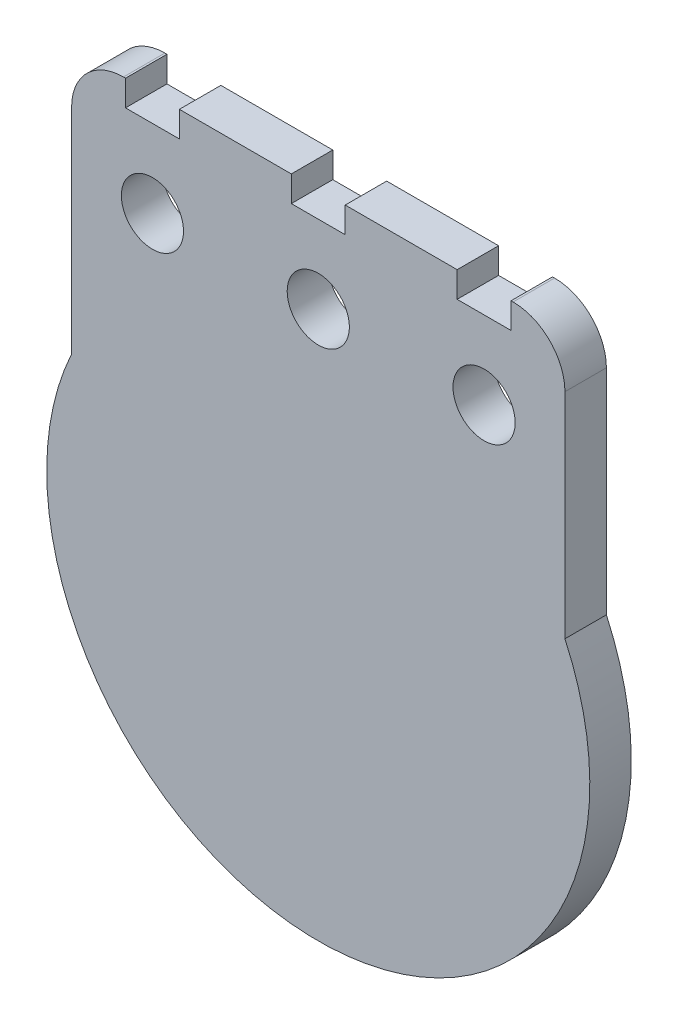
ISO-10303-21;
HEADER;
FILE_DESCRIPTION(('STEP AP214'),'2;1');
FILE_NAME('part.step','',(''),(''),'','','');
FILE_SCHEMA(('AUTOMOTIVE_DESIGN { 1 0 10303 214 1 1 1 1 }'));
ENDSEC;
DATA;
#1=APPLICATION_CONTEXT('core data for automotive mechanical design processes');
#2=APPLICATION_PROTOCOL_DEFINITION('international standard','automotive_design',2000,#1);
#3=PRODUCT_CONTEXT('',#1,'mechanical');
#4=PRODUCT('Part','Part','',(#3));
#5=PRODUCT_RELATED_PRODUCT_CATEGORY('part','',(#4));
#6=PRODUCT_DEFINITION_FORMATION('','',#4);
#7=PRODUCT_DEFINITION_CONTEXT('part definition',#1,'design');
#8=PRODUCT_DEFINITION('design','',#6,#7);
#9=PRODUCT_DEFINITION_SHAPE('','',#8);
#10=(LENGTH_UNIT() NAMED_UNIT(*) SI_UNIT(.MILLI.,.METRE.));
#11=(NAMED_UNIT(*) PLANE_ANGLE_UNIT() SI_UNIT($,.RADIAN.));
#12=(NAMED_UNIT(*) SI_UNIT($,.STERADIAN.) SOLID_ANGLE_UNIT());
#13=UNCERTAINTY_MEASURE_WITH_UNIT(LENGTH_MEASURE(1.E-05),#10,'distance_accuracy_value','');
#14=(GEOMETRIC_REPRESENTATION_CONTEXT(3) GLOBAL_UNCERTAINTY_ASSIGNED_CONTEXT((#13)) GLOBAL_UNIT_ASSIGNED_CONTEXT((#10,
#11,#12)) REPRESENTATION_CONTEXT('',''));
#15=CARTESIAN_POINT('',(0.,0.,0.));
#16=DIRECTION('',(0.,0.,1.));
#17=DIRECTION('',(1.,0.,0.));
#18=AXIS2_PLACEMENT_3D('',#15,#16,#17);
#19=CARTESIAN_POINT('',(0.8255,10.8331,1.27));
#20=DIRECTION('',(1.,0.,0.));
#21=DIRECTION('',(0.,0.,-1.));
#22=AXIS2_PLACEMENT_3D('',#19,#20,#21);
#23=PLANE('',#22);
#24=DIRECTION('',(0.,0.,1.));
#25=VECTOR('',#24,1.);
#26=CARTESIAN_POINT('',(0.8255,11.6205,0.635));
#27=LINE('',#26,#25);
#28=CARTESIAN_POINT('',(0.825499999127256,11.6205,0.));
#29=VERTEX_POINT('',#28);
#30=CARTESIAN_POINT('',(0.825499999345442,11.6205,1.27));
#31=VERTEX_POINT('',#30);
#32=EDGE_CURVE('E262',#29,#31,#27,.T.);
#33=ORIENTED_EDGE('',*,*,#32,.F.);
#34=DIRECTION('',(0.,-1.,0.));
#35=VECTOR('',#34,1.);
#36=CARTESIAN_POINT('',(0.825499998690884,1.591183,0.));
#37=LINE('',#36,#35);
#38=CARTESIAN_POINT('',(0.825499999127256,10.8331000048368,0.));
#39=VERTEX_POINT('',#38);
#40=EDGE_CURVE('E250',#29,#39,#37,.T.);
#41=ORIENTED_EDGE('',*,*,#40,.T.);
#42=DIRECTION('',(0.,0.,1.));
#43=VECTOR('',#42,1.);
#44=CARTESIAN_POINT('',(0.8255,10.8331,0.635));
#45=LINE('',#44,#43);
#46=CARTESIAN_POINT('',(0.825499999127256,10.8331000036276,1.27));
#47=VERTEX_POINT('',#46);
#48=EDGE_CURVE('E245',#39,#47,#45,.T.);
#49=ORIENTED_EDGE('',*,*,#48,.T.);
#50=DIRECTION('',(0.,-1.,0.));
#51=VECTOR('',#50,1.);
#52=CARTESIAN_POINT('',(0.825499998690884,1.591183,1.27));
#53=LINE('',#52,#51);
#54=EDGE_CURVE('E301',#31,#47,#53,.T.);
#55=ORIENTED_EDGE('',*,*,#54,.F.);
#56=EDGE_LOOP('',(#33,#41,#49,#55));
#57=FACE_BOUND('',#56,.T.);
#58=ADVANCED_FACE('F15',(#57),#23,.F.);
#59=CARTESIAN_POINT('',(-0.8255,10.8331,1.27));
#60=DIRECTION('',(0.,-1.,0.));
#61=DIRECTION('',(0.,0.,-1.));
#62=AXIS2_PLACEMENT_3D('',#59,#60,#61);
#63=PLANE('',#62);
#64=ORIENTED_EDGE('',*,*,#48,.F.);
#65=DIRECTION('',(-1.,0.,0.));
#66=VECTOR('',#65,1.);
#67=CARTESIAN_POINT('',(0.,10.8331000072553,0.));
#68=LINE('',#67,#66);
#69=CARTESIAN_POINT('',(-0.825499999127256,10.8331000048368,0.));
#70=VERTEX_POINT('',#69);
#71=EDGE_CURVE('E240',#39,#70,#68,.T.);
#72=ORIENTED_EDGE('',*,*,#71,.T.);
#73=DIRECTION('',(0.,0.,1.));
#74=VECTOR('',#73,1.);
#75=CARTESIAN_POINT('',(-0.8255,10.8331,0.635));
#76=LINE('',#75,#74);
#77=CARTESIAN_POINT('',(-0.825499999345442,10.8331000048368,1.27));
#78=VERTEX_POINT('',#77);
#79=EDGE_CURVE('E235',#70,#78,#76,.T.);
#80=ORIENTED_EDGE('',*,*,#79,.T.);
#81=DIRECTION('',(-1.,0.,0.));
#82=VECTOR('',#81,1.);
#83=CARTESIAN_POINT('',(0.,10.8331000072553,1.27));
#84=LINE('',#83,#82);
#85=EDGE_CURVE('E297',#47,#78,#84,.T.);
#86=ORIENTED_EDGE('',*,*,#85,.F.);
#87=EDGE_LOOP('',(#64,#72,#80,#86));
#88=FACE_BOUND('',#87,.T.);
#89=ADVANCED_FACE('F395',(#88),#63,.F.);
#90=CARTESIAN_POINT('',(-0.8255,10.8331,0.));
#91=DIRECTION('',(-1.,0.,0.));
#92=DIRECTION('',(0.,0.,1.));
#93=AXIS2_PLACEMENT_3D('',#90,#91,#92);
#94=PLANE('',#93);
#95=ORIENTED_EDGE('',*,*,#79,.F.);
#96=DIRECTION('',(0.,1.,0.));
#97=VECTOR('',#96,1.);
#98=CARTESIAN_POINT('',(-0.825499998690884,1.591183,0.));
#99=LINE('',#98,#97);
#100=CARTESIAN_POINT('',(-0.825499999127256,11.6205,0.));
#101=VERTEX_POINT('',#100);
#102=EDGE_CURVE('E231',#70,#101,#99,.T.);
#103=ORIENTED_EDGE('',*,*,#102,.T.);
#104=DIRECTION('',(0.,0.,-1.));
#105=VECTOR('',#104,1.);
#106=CARTESIAN_POINT('',(-0.8255,11.6205,0.635));
#107=LINE('',#106,#105);
#108=CARTESIAN_POINT('',(-0.825499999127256,11.6205,1.27));
#109=VERTEX_POINT('',#108);
#110=EDGE_CURVE('E226',#109,#101,#107,.T.);
#111=ORIENTED_EDGE('',*,*,#110,.F.);
#112=DIRECTION('',(0.,1.,0.));
#113=VECTOR('',#112,1.);
#114=CARTESIAN_POINT('',(-0.825499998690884,1.591183,1.27));
#115=LINE('',#114,#113);
#116=EDGE_CURVE('E293',#78,#109,#115,.T.);
#117=ORIENTED_EDGE('',*,*,#116,.F.);
#118=EDGE_LOOP('',(#95,#103,#111,#117));
#119=FACE_BOUND('',#118,.T.);
#120=ADVANCED_FACE('F400',(#119),#94,.F.);
#121=CARTESIAN_POINT('',(-0.8255,11.6205,0.));
#122=DIRECTION('',(0.,1.,0.));
#123=DIRECTION('',(-1.,0.,0.));
#124=AXIS2_PLACEMENT_3D('',#121,#122,#123);
#125=PLANE('',#124);
#126=DIRECTION('',(0.,0.,1.));
#127=VECTOR('',#126,1.);
#128=CARTESIAN_POINT('',(-4.2545,11.6205,0.635));
#129=LINE('',#128,#127);
#130=CARTESIAN_POINT('',(-4.25449999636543,11.6205,0.));
#131=VERTEX_POINT('',#130);
#132=CARTESIAN_POINT('',(-4.25449999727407,11.6205,1.27));
#133=VERTEX_POINT('',#132);
#134=EDGE_CURVE('E216',#131,#133,#129,.T.);
#135=ORIENTED_EDGE('',*,*,#134,.T.);
#136=DIRECTION('',(-1.,0.,0.));
#137=VECTOR('',#136,1.);
#138=CARTESIAN_POINT('',(0.,11.6205,1.27));
#139=LINE('',#138,#137);
#140=EDGE_CURVE('E289',#109,#133,#139,.T.);
#141=ORIENTED_EDGE('',*,*,#140,.F.);
#142=ORIENTED_EDGE('',*,*,#110,.T.);
#143=DIRECTION('',(-1.,0.,0.));
#144=VECTOR('',#143,1.);
#145=CARTESIAN_POINT('',(0.,11.6205,0.));
#146=LINE('',#145,#144);
#147=EDGE_CURVE('E221',#101,#131,#146,.T.);
#148=ORIENTED_EDGE('',*,*,#147,.T.);
#149=EDGE_LOOP('',(#135,#141,#142,#148));
#150=FACE_BOUND('',#149,.T.);
#151=ADVANCED_FACE('F404',(#150),#125,.T.);
#152=CARTESIAN_POINT('',(-4.2545,10.8331,1.27));
#153=DIRECTION('',(1.,0.,0.));
#154=DIRECTION('',(0.,0.,-1.));
#155=AXIS2_PLACEMENT_3D('',#152,#153,#154);
#156=PLANE('',#155);
#157=ORIENTED_EDGE('',*,*,#134,.F.);
#158=DIRECTION('',(0.,-1.,0.));
#159=VECTOR('',#158,1.);
#160=CARTESIAN_POINT('',(-4.25449999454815,1.591183,0.));
#161=LINE('',#160,#159);
#162=CARTESIAN_POINT('',(-4.25449999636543,10.8331000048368,0.));
#163=VERTEX_POINT('',#162);
#164=EDGE_CURVE('E211',#131,#163,#161,.T.);
#165=ORIENTED_EDGE('',*,*,#164,.T.);
#166=DIRECTION('',(0.,0.,1.));
#167=VECTOR('',#166,1.);
#168=CARTESIAN_POINT('',(-4.2545,10.8331,0.635));
#169=LINE('',#168,#167);
#170=CARTESIAN_POINT('',(-4.25449999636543,10.8331000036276,1.27));
#171=VERTEX_POINT('',#170);
#172=EDGE_CURVE('E206',#163,#171,#169,.T.);
#173=ORIENTED_EDGE('',*,*,#172,.T.);
#174=DIRECTION('',(0.,-1.,0.));
#175=VECTOR('',#174,1.);
#176=CARTESIAN_POINT('',(-4.25449999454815,1.591183,1.27));
#177=LINE('',#176,#175);
#178=EDGE_CURVE('E285',#133,#171,#177,.T.);
#179=ORIENTED_EDGE('',*,*,#178,.F.);
#180=EDGE_LOOP('',(#157,#165,#173,#179));
#181=FACE_BOUND('',#180,.T.);
#182=ADVANCED_FACE('F408',(#181),#156,.F.);
#183=CARTESIAN_POINT('',(-5.9055,10.8331,1.27));
#184=DIRECTION('',(0.,-1.,0.));
#185=DIRECTION('',(0.,0.,-1.));
#186=AXIS2_PLACEMENT_3D('',#183,#184,#185);
#187=PLANE('',#186);
#188=ORIENTED_EDGE('',*,*,#172,.F.);
#189=DIRECTION('',(-1.,0.,0.));
#190=VECTOR('',#189,1.);
#191=CARTESIAN_POINT('',(0.,10.8331000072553,0.));
#192=LINE('',#191,#190);
#193=CARTESIAN_POINT('',(-5.90549999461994,10.8331000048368,0.));
#194=VERTEX_POINT('',#193);
#195=EDGE_CURVE('E201',#163,#194,#192,.T.);
#196=ORIENTED_EDGE('',*,*,#195,.T.);
#197=DIRECTION('',(0.,0.,1.));
#198=VECTOR('',#197,1.);
#199=CARTESIAN_POINT('',(-5.9055,10.8331,0.635));
#200=LINE('',#199,#198);
#201=CARTESIAN_POINT('',(-5.90549999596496,10.8331000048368,1.27));
#202=VERTEX_POINT('',#201);
#203=EDGE_CURVE('E194',#194,#202,#200,.T.);
#204=ORIENTED_EDGE('',*,*,#203,.T.);
#205=DIRECTION('',(-1.,0.,0.));
#206=VECTOR('',#205,1.);
#207=CARTESIAN_POINT('',(0.,10.8331000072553,1.27));
#208=LINE('',#207,#206);
#209=EDGE_CURVE('E281',#171,#202,#208,.T.);
#210=ORIENTED_EDGE('',*,*,#209,.F.);
#211=EDGE_LOOP('',(#188,#196,#204,#210));
#212=FACE_BOUND('',#211,.T.);
#213=ADVANCED_FACE('F413',(#212),#187,.F.);
#214=CARTESIAN_POINT('',(-5.9055,10.8331,0.));
#215=DIRECTION('',(-1.,0.,0.));
#216=DIRECTION('',(0.,0.,1.));
#217=AXIS2_PLACEMENT_3D('',#214,#215,#216);
#218=PLANE('',#217);
#219=ORIENTED_EDGE('',*,*,#203,.F.);
#220=DIRECTION('',(0.,1.,0.));
#221=VECTOR('',#220,1.);
#222=CARTESIAN_POINT('',(-5.90549999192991,1.591183,0.));
#223=LINE('',#222,#221);
#224=CARTESIAN_POINT('',(-5.90549999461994,11.6205,0.));
#225=VERTEX_POINT('',#224);
#226=EDGE_CURVE('E197',#194,#225,#223,.T.);
#227=ORIENTED_EDGE('',*,*,#226,.T.);
#228=DIRECTION('',(0.,0.,-1.));
#229=VECTOR('',#228,1.);
#230=CARTESIAN_POINT('',(-5.9055,11.6205,0.635));
#231=LINE('',#230,#229);
#232=CARTESIAN_POINT('',(-5.90549999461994,11.6205,1.27));
#233=VERTEX_POINT('',#232);
#234=EDGE_CURVE('E192',#233,#225,#231,.T.);
#235=ORIENTED_EDGE('',*,*,#234,.F.);
#236=DIRECTION('',(0.,1.,0.));
#237=VECTOR('',#236,1.);
#238=CARTESIAN_POINT('',(-5.90549999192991,1.591183,1.27));
#239=LINE('',#238,#237);
#240=EDGE_CURVE('E164',#202,#233,#239,.T.);
#241=ORIENTED_EDGE('',*,*,#240,.F.);
#242=EDGE_LOOP('',(#219,#227,#235,#241));
#243=FACE_BOUND('',#242,.T.);
#244=ADVANCED_FACE('F417',(#243),#218,.F.);
#245=CARTESIAN_POINT('',(-5.9055,11.6205,0.));
#246=DIRECTION('',(0.,1.,0.));
#247=DIRECTION('',(-1.,0.,0.));
#248=AXIS2_PLACEMENT_3D('',#245,#246,#247);
#249=PLANE('',#248);
#250=DIRECTION('',(0.,0.,-1.));
#251=VECTOR('',#250,1.);
#252=CARTESIAN_POINT('',(-5.9690000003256,11.6205,0.635));
#253=LINE('',#252,#251);
#254=CARTESIAN_POINT('',(-5.9690000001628,11.6205,0.));
#255=VERTEX_POINT('',#254);
#256=CARTESIAN_POINT('',(-5.9690000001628,11.6205,1.27));
#257=VERTEX_POINT('',#256);
#258=EDGE_CURVE('E153',#255,#257,#253,.F.);
#259=ORIENTED_EDGE('',*,*,#258,.T.);
#260=DIRECTION('',(-1.,0.,0.));
#261=VECTOR('',#260,1.);
#262=CARTESIAN_POINT('',(0.,11.6205,1.27));
#263=LINE('',#262,#261);
#264=EDGE_CURVE('E133',#233,#257,#263,.T.);
#265=ORIENTED_EDGE('',*,*,#264,.F.);
#266=ORIENTED_EDGE('',*,*,#234,.T.);
#267=DIRECTION('',(-1.,0.,0.));
#268=VECTOR('',#267,1.);
#269=CARTESIAN_POINT('',(0.,11.6205,0.));
#270=LINE('',#269,#268);
#271=EDGE_CURVE('E200',#225,#255,#270,.T.);
#272=ORIENTED_EDGE('',*,*,#271,.T.);
#273=EDGE_LOOP('',(#259,#265,#266,#272));
#274=FACE_BOUND('',#273,.T.);
#275=ADVANCED_FACE('F421',(#274),#249,.T.);
#276=CARTESIAN_POINT('',(-5.969,10.033,0.));
#277=DIRECTION('',(0.,0.,1.));
#278=DIRECTION('',(1.,0.,0.));
#279=AXIS2_PLACEMENT_3D('',#276,#277,#278);
#280=CYLINDRICAL_SURFACE('',#279,1.5875);
#281=DIRECTION('',(0.,0.,-1.));
#282=VECTOR('',#281,1.);
#283=CARTESIAN_POINT('',(-7.5565,10.033,0.635));
#284=LINE('',#283,#282);
#285=CARTESIAN_POINT('',(-7.55650000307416,10.033,1.27));
#286=VERTEX_POINT('',#285);
#287=CARTESIAN_POINT('',(-7.55650000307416,10.033,0.));
#288=VERTEX_POINT('',#287);
#289=EDGE_CURVE('E145',#286,#288,#284,.T.);
#290=ORIENTED_EDGE('',*,*,#289,.F.);
#291=CARTESIAN_POINT('',(-5.969,10.033,1.27));
#292=DIRECTION('',(0.,0.,1.));
#293=DIRECTION('',(1.,0.,0.));
#294=AXIS2_PLACEMENT_3D('',#291,#292,#293);
#295=CIRCLE('',#294,1.5875);
#296=EDGE_CURVE('E19',#257,#286,#295,.T.);
#297=ORIENTED_EDGE('',*,*,#296,.F.);
#298=ORIENTED_EDGE('',*,*,#258,.F.);
#299=CARTESIAN_POINT('',(-5.969,10.033,0.));
#300=DIRECTION('',(0.,0.,1.));
#301=DIRECTION('',(1.,0.,0.));
#302=AXIS2_PLACEMENT_3D('',#299,#300,#301);
#303=CIRCLE('',#302,1.5875);
#304=EDGE_CURVE('E148',#255,#288,#303,.T.);
#305=ORIENTED_EDGE('',*,*,#304,.T.);
#306=EDGE_LOOP('',(#290,#297,#298,#305));
#307=FACE_BOUND('',#306,.T.);
#308=ADVANCED_FACE('F146',(#307),#280,.T.);
#309=CARTESIAN_POINT('',(-7.5565,3.4780382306,0.));
#310=DIRECTION('',(-1.,0.,0.));
#311=DIRECTION('',(0.,0.,1.));
#312=AXIS2_PLACEMENT_3D('',#309,#310,#311);
#313=PLANE('',#312);
#314=DIRECTION('',(0.,-1.,0.));
#315=VECTOR('',#314,1.);
#316=CARTESIAN_POINT('',(-7.55650000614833,1.591183,0.));
#317=LINE('',#316,#315);
#318=CARTESIAN_POINT('',(-7.55650000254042,3.47803823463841,0.));
#319=VERTEX_POINT('',#318);
#320=EDGE_CURVE('E348',#288,#319,#317,.T.);
#321=ORIENTED_EDGE('',*,*,#320,.T.);
#322=DIRECTION('',(0.,0.,-1.));
#323=VECTOR('',#322,1.);
#324=CARTESIAN_POINT('',(-7.55649999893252,3.47803824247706,0.635));
#325=LINE('',#324,#323);
#326=CARTESIAN_POINT('',(-7.55650000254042,3.47803823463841,1.27));
#327=VERTEX_POINT('',#326);
#328=EDGE_CURVE('E152',#319,#327,#325,.F.);
#329=ORIENTED_EDGE('',*,*,#328,.T.);
#330=DIRECTION('',(0.,-1.,0.));
#331=VECTOR('',#330,1.);
#332=CARTESIAN_POINT('',(-7.55650000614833,1.591183,1.27));
#333=LINE('',#332,#331);
#334=EDGE_CURVE('E141',#286,#327,#333,.T.);
#335=ORIENTED_EDGE('',*,*,#334,.F.);
#336=ORIENTED_EDGE('',*,*,#289,.T.);
#337=EDGE_LOOP('',(#321,#329,#335,#336));
#338=FACE_BOUND('',#337,.T.);
#339=ADVANCED_FACE('F155',(#338),#313,.T.);
#340=CARTESIAN_POINT('',(0.,0.,1.27));
#341=DIRECTION('',(0.,0.,-1.));
#342=DIRECTION('',(-1.,0.,0.));
#343=AXIS2_PLACEMENT_3D('',#340,#341,#342);
#344=CYLINDRICAL_SURFACE('',#343,8.3185);
#345=CARTESIAN_POINT('',(0.,0.,1.27));
#346=DIRECTION('',(0.,0.,-1.));
#347=DIRECTION('',(-1.,0.,0.));
#348=AXIS2_PLACEMENT_3D('',#345,#346,#347);
#349=CIRCLE('',#348,8.3185);
#350=CARTESIAN_POINT('',(7.55650000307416,3.47803822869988,1.27));
#351=VERTEX_POINT('',#350);
#352=EDGE_CURVE('E157',#327,#351,#349,.F.);
#353=ORIENTED_EDGE('',*,*,#352,.F.);
#354=ORIENTED_EDGE('',*,*,#328,.F.);
#355=CARTESIAN_POINT('',(0.,0.,0.));
#356=DIRECTION('',(0.,0.,-1.));
#357=DIRECTION('',(-1.,0.,0.));
#358=AXIS2_PLACEMENT_3D('',#355,#356,#357);
#359=CIRCLE('',#358,8.3185);
#360=CARTESIAN_POINT('',(7.55650000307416,3.47803822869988,0.));
#361=VERTEX_POINT('',#360);
#362=EDGE_CURVE('E345',#319,#361,#359,.F.);
#363=ORIENTED_EDGE('',*,*,#362,.T.);
#364=DIRECTION('',(0.,0.,-1.));
#365=VECTOR('',#364,1.);
#366=CARTESIAN_POINT('',(7.5565,3.4780382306,0.635));
#367=LINE('',#366,#365);
#368=EDGE_CURVE('E188',#351,#361,#367,.T.);
#369=ORIENTED_EDGE('',*,*,#368,.F.);
#370=EDGE_LOOP('',(#353,#354,#363,#369));
#371=FACE_BOUND('',#370,.T.);
#372=ADVANCED_FACE('F432',(#371),#344,.T.);
#373=CARTESIAN_POINT('',(7.5565,3.4780382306,1.27));
#374=DIRECTION('',(1.,0.,0.));
#375=DIRECTION('',(0.,0.,-1.));
#376=AXIS2_PLACEMENT_3D('',#373,#374,#375);
#377=PLANE('',#376);
#378=DIRECTION('',(0.,1.,0.));
#379=VECTOR('',#378,1.);
#380=CARTESIAN_POINT('',(7.55650000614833,1.591183,1.27));
#381=LINE('',#380,#379);
#382=CARTESIAN_POINT('',(7.55650000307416,10.033,1.27));
#383=VERTEX_POINT('',#382);
#384=EDGE_CURVE('E159',#351,#383,#381,.T.);
#385=ORIENTED_EDGE('',*,*,#384,.F.);
#386=ORIENTED_EDGE('',*,*,#368,.T.);
#387=DIRECTION('',(0.,1.,0.));
#388=VECTOR('',#387,1.);
#389=CARTESIAN_POINT('',(7.55650000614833,1.591183,0.));
#390=LINE('',#389,#388);
#391=CARTESIAN_POINT('',(7.55650000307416,10.033,0.));
#392=VERTEX_POINT('',#391);
#393=EDGE_CURVE('E344',#361,#392,#390,.T.);
#394=ORIENTED_EDGE('',*,*,#393,.T.);
#395=DIRECTION('',(0.,0.,-1.));
#396=VECTOR('',#395,1.);
#397=CARTESIAN_POINT('',(7.5565,10.033,0.635));
#398=LINE('',#397,#396);
#399=EDGE_CURVE('E174',#392,#383,#398,.F.);
#400=ORIENTED_EDGE('',*,*,#399,.T.);
#401=EDGE_LOOP('',(#385,#386,#394,#400));
#402=FACE_BOUND('',#401,.T.);
#403=ADVANCED_FACE('F362',(#402),#377,.T.);
#404=CARTESIAN_POINT('',(5.969,10.033,0.));
#405=DIRECTION('',(0.,0.,1.));
#406=DIRECTION('',(1.,0.,0.));
#407=AXIS2_PLACEMENT_3D('',#404,#405,#406);
#408=CYLINDRICAL_SURFACE('',#407,1.5875);
#409=DIRECTION('',(0.,0.,-1.));
#410=VECTOR('',#409,1.);
#411=CARTESIAN_POINT('',(5.969,11.6205,0.635));
#412=LINE('',#411,#410);
#413=CARTESIAN_POINT('',(5.969,11.6205,1.27));
#414=VERTEX_POINT('',#413);
#415=CARTESIAN_POINT('',(5.969,11.6205,0.));
#416=VERTEX_POINT('',#415);
#417=EDGE_CURVE('E172',#414,#416,#412,.T.);
#418=ORIENTED_EDGE('',*,*,#417,.F.);
#419=CARTESIAN_POINT('',(5.969,10.033,1.27));
#420=DIRECTION('',(0.,0.,1.));
#421=DIRECTION('',(1.,0.,0.));
#422=AXIS2_PLACEMENT_3D('',#419,#420,#421);
#423=CIRCLE('',#422,1.5875);
#424=EDGE_CURVE('E354',#383,#414,#423,.T.);
#425=ORIENTED_EDGE('',*,*,#424,.F.);
#426=ORIENTED_EDGE('',*,*,#399,.F.);
#427=CARTESIAN_POINT('',(5.969,10.033,0.));
#428=DIRECTION('',(0.,0.,1.));
#429=DIRECTION('',(1.,0.,0.));
#430=AXIS2_PLACEMENT_3D('',#427,#428,#429);
#431=CIRCLE('',#430,1.5875);
#432=EDGE_CURVE('E341',#392,#416,#431,.T.);
#433=ORIENTED_EDGE('',*,*,#432,.T.);
#434=EDGE_LOOP('',(#418,#425,#426,#433));
#435=FACE_BOUND('',#434,.T.);
#436=ADVANCED_FACE('F366',(#435),#408,.T.);
#437=CARTESIAN_POINT('',(5.969,11.6205,0.));
#438=DIRECTION('',(0.,1.,0.));
#439=DIRECTION('',(-1.,0.,0.));
#440=AXIS2_PLACEMENT_3D('',#437,#438,#439);
#441=PLANE('',#440);
#442=ORIENTED_EDGE('',*,*,#417,.T.);
#443=DIRECTION('',(-1.,0.,0.));
#444=VECTOR('',#443,1.);
#445=CARTESIAN_POINT('',(0.,11.6205,0.));
#446=LINE('',#445,#444);
#447=CARTESIAN_POINT('',(5.90549999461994,11.6205,0.));
#448=VERTEX_POINT('',#447);
#449=EDGE_CURVE('E179',#416,#448,#446,.T.);
#450=ORIENTED_EDGE('',*,*,#449,.T.);
#451=DIRECTION('',(0.,0.,1.));
#452=VECTOR('',#451,1.);
#453=CARTESIAN_POINT('',(5.9055,11.6205,0.635));
#454=LINE('',#453,#452);
#455=CARTESIAN_POINT('',(5.90549999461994,11.6205,1.27));
#456=VERTEX_POINT('',#455);
#457=EDGE_CURVE('E171',#448,#456,#454,.T.);
#458=ORIENTED_EDGE('',*,*,#457,.T.);
#459=DIRECTION('',(-1.,0.,0.));
#460=VECTOR('',#459,1.);
#461=CARTESIAN_POINT('',(0.,11.6205,1.27));
#462=LINE('',#461,#460);
#463=EDGE_CURVE('E277',#414,#456,#462,.T.);
#464=ORIENTED_EDGE('',*,*,#463,.F.);
#465=EDGE_LOOP('',(#442,#450,#458,#464));
#466=FACE_BOUND('',#465,.T.);
#467=ADVANCED_FACE('F371',(#466),#441,.T.);
#468=CARTESIAN_POINT('',(5.9055,10.8331,1.27));
#469=DIRECTION('',(1.,0.,0.));
#470=DIRECTION('',(0.,0.,-1.));
#471=AXIS2_PLACEMENT_3D('',#468,#469,#470);
#472=PLANE('',#471);
#473=ORIENTED_EDGE('',*,*,#457,.F.);
#474=DIRECTION('',(0.,-1.,0.));
#475=VECTOR('',#474,1.);
#476=CARTESIAN_POINT('',(5.90549999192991,1.591183,0.));
#477=LINE('',#476,#475);
#478=CARTESIAN_POINT('',(5.90549999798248,10.8331000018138,0.));
#479=VERTEX_POINT('',#478);
#480=EDGE_CURVE('E175',#448,#479,#477,.T.);
#481=ORIENTED_EDGE('',*,*,#480,.T.);
#482=DIRECTION('',(0.,0.,1.));
#483=VECTOR('',#482,1.);
#484=CARTESIAN_POINT('',(5.9055,10.8331,0.635));
#485=LINE('',#484,#483);
#486=CARTESIAN_POINT('',(5.90549999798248,10.8331000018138,1.27));
#487=VERTEX_POINT('',#486);
#488=EDGE_CURVE('E167',#479,#487,#485,.T.);
#489=ORIENTED_EDGE('',*,*,#488,.T.);
#490=DIRECTION('',(0.,-1.,0.));
#491=VECTOR('',#490,1.);
#492=CARTESIAN_POINT('',(5.90549999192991,1.591183,1.27));
#493=LINE('',#492,#491);
#494=EDGE_CURVE('E274',#456,#487,#493,.T.);
#495=ORIENTED_EDGE('',*,*,#494,.F.);
#496=EDGE_LOOP('',(#473,#481,#489,#495));
#497=FACE_BOUND('',#496,.T.);
#498=ADVANCED_FACE('F378',(#497),#472,.F.);
#499=CARTESIAN_POINT('',(4.2545,10.8331,1.27));
#500=DIRECTION('',(0.,-1.,0.));
#501=DIRECTION('',(0.,0.,-1.));
#502=AXIS2_PLACEMENT_3D('',#499,#500,#501);
#503=PLANE('',#502);
#504=ORIENTED_EDGE('',*,*,#488,.F.);
#505=DIRECTION('',(-1.,0.,0.));
#506=VECTOR('',#505,1.);
#507=CARTESIAN_POINT('',(0.,10.8331000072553,0.));
#508=LINE('',#507,#506);
#509=CARTESIAN_POINT('',(4.25449999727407,10.8331000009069,0.));
#510=VERTEX_POINT('',#509);
#511=EDGE_CURVE('E178',#479,#510,#508,.T.);
#512=ORIENTED_EDGE('',*,*,#511,.T.);
#513=DIRECTION('',(0.,0.,1.));
#514=VECTOR('',#513,1.);
#515=CARTESIAN_POINT('',(4.2545,10.8331,0.635));
#516=LINE('',#515,#514);
#517=CARTESIAN_POINT('',(4.25449999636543,10.8331000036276,1.27));
#518=VERTEX_POINT('',#517);
#519=EDGE_CURVE('E170',#510,#518,#516,.T.);
#520=ORIENTED_EDGE('',*,*,#519,.T.);
#521=DIRECTION('',(-1.,0.,0.));
#522=VECTOR('',#521,1.);
#523=CARTESIAN_POINT('',(0.,10.8331000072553,1.27));
#524=LINE('',#523,#522);
#525=EDGE_CURVE('E276',#487,#518,#524,.T.);
#526=ORIENTED_EDGE('',*,*,#525,.F.);
#527=EDGE_LOOP('',(#504,#512,#520,#526));
#528=FACE_BOUND('',#527,.T.);
#529=ADVANCED_FACE('F382',(#528),#503,.F.);
#530=CARTESIAN_POINT('',(4.2545,10.8331,0.));
#531=DIRECTION('',(-1.,0.,0.));
#532=DIRECTION('',(0.,0.,1.));
#533=AXIS2_PLACEMENT_3D('',#530,#531,#532);
#534=PLANE('',#533);
#535=ORIENTED_EDGE('',*,*,#519,.F.);
#536=DIRECTION('',(0.,1.,0.));
#537=VECTOR('',#536,1.);
#538=CARTESIAN_POINT('',(4.25449999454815,1.591183,0.));
#539=LINE('',#538,#537);
#540=CARTESIAN_POINT('',(4.25449999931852,11.6205,0.));
#541=VERTEX_POINT('',#540);
#542=EDGE_CURVE('E271',#510,#541,#539,.T.);
#543=ORIENTED_EDGE('',*,*,#542,.T.);
#544=DIRECTION('',(0.,0.,-1.));
#545=VECTOR('',#544,1.);
#546=CARTESIAN_POINT('',(4.2545,11.6205,0.635));
#547=LINE('',#546,#545);
#548=CARTESIAN_POINT('',(4.25449999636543,11.6205,1.27));
#549=VERTEX_POINT('',#548);
#550=EDGE_CURVE('E34',#549,#541,#547,.T.);
#551=ORIENTED_EDGE('',*,*,#550,.F.);
#552=DIRECTION('',(0.,1.,0.));
#553=VECTOR('',#552,1.);
#554=CARTESIAN_POINT('',(4.25449999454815,1.591183,1.27));
#555=LINE('',#554,#553);
#556=EDGE_CURVE('E265',#518,#549,#555,.T.);
#557=ORIENTED_EDGE('',*,*,#556,.F.);
#558=EDGE_LOOP('',(#535,#543,#551,#557));
#559=FACE_BOUND('',#558,.T.);
#560=ADVANCED_FACE('F385',(#559),#534,.F.);
#561=CARTESIAN_POINT('',(4.2545,11.6205,0.));
#562=DIRECTION('',(0.,1.,0.));
#563=DIRECTION('',(-1.,0.,0.));
#564=AXIS2_PLACEMENT_3D('',#561,#562,#563);
#565=PLANE('',#564);
#566=ORIENTED_EDGE('',*,*,#32,.T.);
#567=DIRECTION('',(-1.,0.,0.));
#568=VECTOR('',#567,1.);
#569=CARTESIAN_POINT('',(0.,11.6205,1.27));
#570=LINE('',#569,#568);
#571=EDGE_CURVE('E305',#549,#31,#570,.T.);
#572=ORIENTED_EDGE('',*,*,#571,.F.);
#573=ORIENTED_EDGE('',*,*,#550,.T.);
#574=DIRECTION('',(-1.,0.,0.));
#575=VECTOR('',#574,1.);
#576=CARTESIAN_POINT('',(0.,11.6205,0.));
#577=LINE('',#576,#575);
#578=EDGE_CURVE('E268',#541,#29,#577,.T.);
#579=ORIENTED_EDGE('',*,*,#578,.T.);
#580=EDGE_LOOP('',(#566,#572,#573,#579));
#581=FACE_BOUND('',#580,.T.);
#582=ADVANCED_FACE('F390',(#581),#565,.T.);
#583=CARTESIAN_POINT('',(5.08,8.4455,1.27));
#584=DIRECTION('',(0.,0.,-1.));
#585=DIRECTION('',(-1.,0.,0.));
#586=AXIS2_PLACEMENT_3D('',#583,#584,#585);
#587=CYLINDRICAL_SURFACE('',#586,0.9525);
#588=CARTESIAN_POINT('',(5.08,8.4455,1.27));
#589=DIRECTION('',(0.,0.,-1.));
#590=DIRECTION('',(-1.,0.,0.));
#591=AXIS2_PLACEMENT_3D('',#588,#589,#590);
#592=CIRCLE('',#591,0.9525);
#593=CARTESIAN_POINT('',(4.1275,8.4455,1.27));
#594=VERTEX_POINT('',#593);
#595=EDGE_CURVE('E323',#594,#594,#592,.T.);
#596=ORIENTED_EDGE('',*,*,#595,.F.);
#597=EDGE_LOOP('',(#596));
#598=FACE_BOUND('',#597,.T.);
#599=CARTESIAN_POINT('',(5.08,8.4455,0.));
#600=DIRECTION('',(0.,0.,-1.));
#601=DIRECTION('',(-1.,0.,0.));
#602=AXIS2_PLACEMENT_3D('',#599,#600,#601);
#603=CIRCLE('',#602,0.9525);
#604=CARTESIAN_POINT('',(4.1275,8.4455,0.));
#605=VERTEX_POINT('',#604);
#606=EDGE_CURVE('E270',#605,#605,#603,.T.);
#607=ORIENTED_EDGE('',*,*,#606,.T.);
#608=EDGE_LOOP('',(#607));
#609=FACE_BOUND('',#608,.T.);
#610=ADVANCED_FACE('F457',(#598,#609),#587,.F.);
#611=CARTESIAN_POINT('',(0.,8.4455,1.27));
#612=DIRECTION('',(0.,0.,-1.));
#613=DIRECTION('',(-1.,0.,0.));
#614=AXIS2_PLACEMENT_3D('',#611,#612,#613);
#615=CYLINDRICAL_SURFACE('',#614,0.9525);
#616=CARTESIAN_POINT('',(0.,8.4455,1.27));
#617=DIRECTION('',(0.,0.,-1.));
#618=DIRECTION('',(-1.,0.,0.));
#619=AXIS2_PLACEMENT_3D('',#616,#617,#618);
#620=CIRCLE('',#619,0.9525);
#621=CARTESIAN_POINT('',(-0.9525,8.4455,1.27));
#622=VERTEX_POINT('',#621);
#623=EDGE_CURVE('E259',#622,#622,#620,.T.);
#624=ORIENTED_EDGE('',*,*,#623,.F.);
#625=EDGE_LOOP('',(#624));
#626=FACE_BOUND('',#625,.T.);
#627=CARTESIAN_POINT('',(0.,8.4455,0.));
#628=DIRECTION('',(0.,0.,-1.));
#629=DIRECTION('',(-1.,0.,0.));
#630=AXIS2_PLACEMENT_3D('',#627,#628,#629);
#631=CIRCLE('',#630,0.9525);
#632=CARTESIAN_POINT('',(-0.9525,8.4455,0.));
#633=VERTEX_POINT('',#632);
#634=EDGE_CURVE('E336',#633,#633,#631,.T.);
#635=ORIENTED_EDGE('',*,*,#634,.T.);
#636=EDGE_LOOP('',(#635));
#637=FACE_BOUND('',#636,.T.);
#638=ADVANCED_FACE('F454',(#626,#637),#615,.F.);
#639=CARTESIAN_POINT('',(-8.418322,-8.438134,1.27));
#640=DIRECTION('',(0.,0.,1.));
#641=DIRECTION('',(1.,0.,0.));
#642=AXIS2_PLACEMENT_3D('',#639,#640,#641);
#643=PLANE('',#642);
#644=ORIENTED_EDGE('',*,*,#623,.T.);
#645=EDGE_LOOP('',(#644));
#646=FACE_BOUND('',#645,.T.);
#647=ORIENTED_EDGE('',*,*,#595,.T.);
#648=EDGE_LOOP('',(#647));
#649=FACE_BOUND('',#648,.T.);
#650=CARTESIAN_POINT('',(-5.08,8.4455,1.27));
#651=DIRECTION('',(0.,0.,-1.));
#652=DIRECTION('',(-1.,0.,0.));
#653=AXIS2_PLACEMENT_3D('',#650,#651,#652);
#654=CIRCLE('',#653,0.9525);
#655=CARTESIAN_POINT('',(-6.0325,8.4455,1.27));
#656=VERTEX_POINT('',#655);
#657=EDGE_CURVE('E25',#656,#656,#654,.F.);
#658=ORIENTED_EDGE('',*,*,#657,.F.);
#659=EDGE_LOOP('',(#658));
#660=FACE_BOUND('',#659,.T.);
#661=ORIENTED_EDGE('',*,*,#494,.T.);
#662=ORIENTED_EDGE('',*,*,#525,.T.);
#663=ORIENTED_EDGE('',*,*,#556,.T.);
#664=ORIENTED_EDGE('',*,*,#571,.T.);
#665=ORIENTED_EDGE('',*,*,#54,.T.);
#666=ORIENTED_EDGE('',*,*,#85,.T.);
#667=ORIENTED_EDGE('',*,*,#116,.T.);
#668=ORIENTED_EDGE('',*,*,#140,.T.);
#669=ORIENTED_EDGE('',*,*,#178,.T.);
#670=ORIENTED_EDGE('',*,*,#209,.T.);
#671=ORIENTED_EDGE('',*,*,#240,.T.);
#672=ORIENTED_EDGE('',*,*,#264,.T.);
#673=ORIENTED_EDGE('',*,*,#296,.T.);
#674=ORIENTED_EDGE('',*,*,#334,.T.);
#675=ORIENTED_EDGE('',*,*,#352,.T.);
#676=ORIENTED_EDGE('',*,*,#384,.T.);
#677=ORIENTED_EDGE('',*,*,#424,.T.);
#678=ORIENTED_EDGE('',*,*,#463,.T.);
#679=EDGE_LOOP('',(#661,#662,#663,#664,#665,#666,#667,#668,#669,#670,#671,#672,#673,#674,#675,
#676,#677,#678));
#680=FACE_BOUND('',#679,.T.);
#681=ADVANCED_FACE('F139',(#646,#649,#660,#680),#643,.T.);
#682=CARTESIAN_POINT('',(-8.418322,-8.438134,0.));
#683=DIRECTION('',(0.,0.,1.));
#684=DIRECTION('',(1.,0.,0.));
#685=AXIS2_PLACEMENT_3D('',#682,#683,#684);
#686=PLANE('',#685);
#687=ORIENTED_EDGE('',*,*,#634,.F.);
#688=EDGE_LOOP('',(#687));
#689=FACE_BOUND('',#688,.T.);
#690=ORIENTED_EDGE('',*,*,#606,.F.);
#691=EDGE_LOOP('',(#690));
#692=FACE_BOUND('',#691,.T.);
#693=CARTESIAN_POINT('',(-5.08,8.4455,0.));
#694=DIRECTION('',(0.,0.,-1.));
#695=DIRECTION('',(-1.,0.,0.));
#696=AXIS2_PLACEMENT_3D('',#693,#694,#695);
#697=CIRCLE('',#696,0.9525);
#698=CARTESIAN_POINT('',(-6.0325,8.4455,0.));
#699=VERTEX_POINT('',#698);
#700=EDGE_CURVE('E10',#699,#699,#697,.T.);
#701=ORIENTED_EDGE('',*,*,#700,.F.);
#702=EDGE_LOOP('',(#701));
#703=FACE_BOUND('',#702,.T.);
#704=ORIENTED_EDGE('',*,*,#542,.F.);
#705=ORIENTED_EDGE('',*,*,#511,.F.);
#706=ORIENTED_EDGE('',*,*,#480,.F.);
#707=ORIENTED_EDGE('',*,*,#449,.F.);
#708=ORIENTED_EDGE('',*,*,#432,.F.);
#709=ORIENTED_EDGE('',*,*,#393,.F.);
#710=ORIENTED_EDGE('',*,*,#362,.F.);
#711=ORIENTED_EDGE('',*,*,#320,.F.);
#712=ORIENTED_EDGE('',*,*,#304,.F.);
#713=ORIENTED_EDGE('',*,*,#271,.F.);
#714=ORIENTED_EDGE('',*,*,#226,.F.);
#715=ORIENTED_EDGE('',*,*,#195,.F.);
#716=ORIENTED_EDGE('',*,*,#164,.F.);
#717=ORIENTED_EDGE('',*,*,#147,.F.);
#718=ORIENTED_EDGE('',*,*,#102,.F.);
#719=ORIENTED_EDGE('',*,*,#71,.F.);
#720=ORIENTED_EDGE('',*,*,#40,.F.);
#721=ORIENTED_EDGE('',*,*,#578,.F.);
#722=EDGE_LOOP('',(#704,#705,#706,#707,#708,#709,#710,#711,#712,#713,#714,#715,#716,#717,#718,
#719,#720,#721));
#723=FACE_BOUND('',#722,.T.);
#724=ADVANCED_FACE('F17',(#689,#692,#703,#723),#686,.F.);
#725=CARTESIAN_POINT('',(-5.08,8.4455,1.27));
#726=DIRECTION('',(0.,0.,-1.));
#727=DIRECTION('',(-1.,0.,0.));
#728=AXIS2_PLACEMENT_3D('',#725,#726,#727);
#729=CYLINDRICAL_SURFACE('',#728,0.9525);
#730=ORIENTED_EDGE('',*,*,#657,.T.);
#731=EDGE_LOOP('',(#730));
#732=FACE_BOUND('',#731,.T.);
#733=ORIENTED_EDGE('',*,*,#700,.T.);
#734=EDGE_LOOP('',(#733));
#735=FACE_BOUND('',#734,.T.);
#736=ADVANCED_FACE('F444',(#732,#735),#729,.F.);
#737=CLOSED_SHELL('',(#58,#89,#120,#151,#182,#213,#244,#275,#308,#339,#372,#403,#436,#467,#498,
#529,#560,#582,#610,#638,#681,#724,#736));
#738=MANIFOLD_SOLID_BREP('B1',#737);
#739=ADVANCED_BREP_SHAPE_REPRESENTATION('',(#18,#738),#14);
#740=SHAPE_DEFINITION_REPRESENTATION(#9,#739);
ENDSEC;
END-ISO-10303-21;
